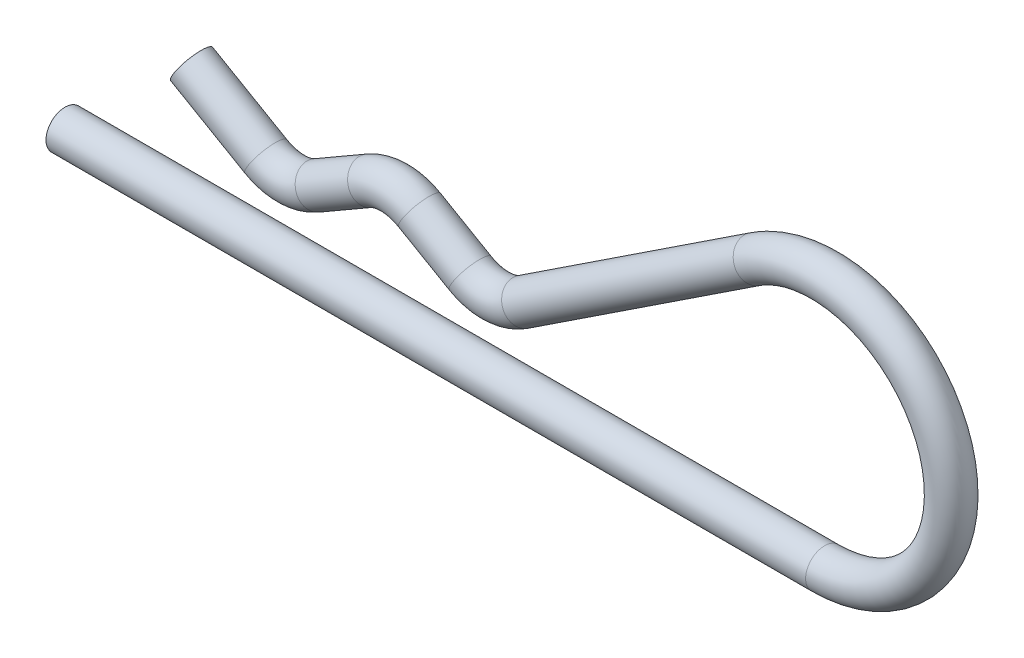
ISO-10303-21;
HEADER;
FILE_DESCRIPTION(('STEP AP214'),'2;1');
FILE_NAME('part.step','',(''),(''),'','','');
FILE_SCHEMA(('AUTOMOTIVE_DESIGN { 1 0 10303 214 1 1 1 1 }'));
ENDSEC;
DATA;
#1=APPLICATION_CONTEXT('core data for automotive mechanical design processes');
#2=APPLICATION_PROTOCOL_DEFINITION('international standard','automotive_design',2000,#1);
#3=PRODUCT_CONTEXT('',#1,'mechanical');
#4=PRODUCT('Part','Part','',(#3));
#5=PRODUCT_RELATED_PRODUCT_CATEGORY('part','',(#4));
#6=PRODUCT_DEFINITION_FORMATION('','',#4);
#7=PRODUCT_DEFINITION_CONTEXT('part definition',#1,'design');
#8=PRODUCT_DEFINITION('design','',#6,#7);
#9=PRODUCT_DEFINITION_SHAPE('','',#8);
#10=(LENGTH_UNIT() NAMED_UNIT(*) SI_UNIT(.MILLI.,.METRE.));
#11=(NAMED_UNIT(*) PLANE_ANGLE_UNIT() SI_UNIT($,.RADIAN.));
#12=(NAMED_UNIT(*) SI_UNIT($,.STERADIAN.) SOLID_ANGLE_UNIT());
#13=UNCERTAINTY_MEASURE_WITH_UNIT(LENGTH_MEASURE(1.E-05),#10,'distance_accuracy_value','');
#14=(GEOMETRIC_REPRESENTATION_CONTEXT(3) GLOBAL_UNCERTAINTY_ASSIGNED_CONTEXT((#13)) GLOBAL_UNIT_ASSIGNED_CONTEXT((#10,
#11,#12)) REPRESENTATION_CONTEXT('',''));
#15=CARTESIAN_POINT('',(0.,0.,0.));
#16=DIRECTION('',(0.,0.,1.));
#17=DIRECTION('',(1.,0.,0.));
#18=AXIS2_PLACEMENT_3D('',#15,#16,#17);
#19=CARTESIAN_POINT('',(9.9999999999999,9.45702875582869,0.));
#20=DIRECTION('',(-0.866025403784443,0.499999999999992,0.));
#21=DIRECTION('',(-0.499999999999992,-0.866025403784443,0.));
#22=AXIS2_PLACEMENT_3D('',#19,#20,#21);
#23=PLANE('',#22);
#24=CARTESIAN_POINT('',(9.99999999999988,9.4570287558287,0.));
#25=DIRECTION('',(-0.866025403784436,0.500000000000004,0.));
#26=DIRECTION('',(-0.500000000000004,-0.866025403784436,0.));
#27=AXIS2_PLACEMENT_3D('',#24,#25,#26);
#28=CIRCLE('',#27,1.5);
#29=CARTESIAN_POINT('',(9.24999999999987,8.15799065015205,0.));
#30=VERTEX_POINT('',#29);
#31=EDGE_CURVE('E17',#30,#30,#28,.F.);
#32=ORIENTED_EDGE('',*,*,#31,.F.);
#33=EDGE_LOOP('',(#32));
#34=FACE_BOUND('',#33,.T.);
#35=ADVANCED_FACE('F14',(#34),#23,.T.);
#36=CARTESIAN_POINT('',(15.8599001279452,6.0738138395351,0.));
#37=DIRECTION('',(-0.866025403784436,0.500000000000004,0.));
#38=DIRECTION('',(-0.500000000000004,-0.866025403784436,0.));
#39=AXIS2_PLACEMENT_3D('',#36,#37,#38);
#40=CYLINDRICAL_SURFACE('',#39,1.5);
#41=ORIENTED_EDGE('',*,*,#31,.T.);
#42=EDGE_LOOP('',(#41));
#43=FACE_BOUND('',#42,.T.);
#44=CARTESIAN_POINT('',(15.8599001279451,6.07381383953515,0.));
#45=DIRECTION('',(-0.866025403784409,0.500000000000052,0.));
#46=DIRECTION('',(-0.500000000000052,-0.866025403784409,0.));
#47=AXIS2_PLACEMENT_3D('',#44,#45,#46);
#48=CIRCLE('',#47,1.5);
#49=CARTESIAN_POINT('',(15.109900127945,4.77477573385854,0.));
#50=VERTEX_POINT('',#49);
#51=EDGE_CURVE('E28',#50,#50,#48,.F.);
#52=ORIENTED_EDGE('',*,*,#51,.F.);
#53=EDGE_LOOP('',(#52));
#54=FACE_BOUND('',#53,.T.);
#55=ADVANCED_FACE('F40',(#43,#54),#40,.T.);
#56=CARTESIAN_POINT('',(17.8599001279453,9.53791545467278,0.));
#57=DIRECTION('',(0.,0.,-1.));
#58=DIRECTION('',(-1.,0.,0.));
#59=AXIS2_PLACEMENT_3D('',#56,#57,#58);
#60=TOROIDAL_SURFACE('',#59,3.99999999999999,1.5);
#61=CARTESIAN_POINT('',(19.8599001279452,6.07381383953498,0.));
#62=DIRECTION('',(-0.866025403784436,-0.500000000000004,0.));
#63=DIRECTION('',(0.500000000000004,-0.866025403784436,0.));
#64=AXIS2_PLACEMENT_3D('',#61,#62,#63);
#65=CIRCLE('',#64,1.5);
#66=CARTESIAN_POINT('',(20.6099001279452,4.77477573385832,0.));
#67=VERTEX_POINT('',#66);
#68=EDGE_CURVE('E31',#67,#67,#65,.F.);
#69=ORIENTED_EDGE('',*,*,#68,.F.);
#70=EDGE_LOOP('',(#69));
#71=FACE_BOUND('',#70,.T.);
#72=ORIENTED_EDGE('',*,*,#51,.T.);
#73=EDGE_LOOP('',(#72));
#74=FACE_BOUND('',#73,.T.);
#75=ADVANCED_FACE('F36',(#71,#74),#60,.T.);
#76=CARTESIAN_POINT('',(23.9999999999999,8.46410161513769,0.));
#77=DIRECTION('',(-0.866025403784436,-0.500000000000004,0.));
#78=DIRECTION('',(0.500000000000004,-0.866025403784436,0.));
#79=AXIS2_PLACEMENT_3D('',#76,#77,#78);
#80=CYLINDRICAL_SURFACE('',#79,1.5);
#81=ORIENTED_EDGE('',*,*,#68,.T.);
#82=EDGE_LOOP('',(#81));
#83=FACE_BOUND('',#82,.T.);
#84=CARTESIAN_POINT('',(23.9999999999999,8.4641016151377,0.));
#85=DIRECTION('',(-0.866025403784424,-0.500000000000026,0.));
#86=DIRECTION('',(-0.500000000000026,0.866025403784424,0.));
#87=AXIS2_PLACEMENT_3D('',#84,#85,#86);
#88=CIRCLE('',#87,1.5);
#89=CARTESIAN_POINT('',(23.2499999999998,9.76313972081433,0.));
#90=VERTEX_POINT('',#89);
#91=EDGE_CURVE('E93',#90,#90,#88,.F.);
#92=ORIENTED_EDGE('',*,*,#91,.F.);
#93=EDGE_LOOP('',(#92));
#94=FACE_BOUND('',#93,.T.);
#95=ADVANCED_FACE('F39',(#83,#94),#80,.T.);
#96=CARTESIAN_POINT('',(26.,5.,0.));
#97=DIRECTION('',(0.,0.,1.));
#98=DIRECTION('',(1.,0.,0.));
#99=AXIS2_PLACEMENT_3D('',#96,#97,#98);
#100=TOROIDAL_SURFACE('',#99,4.,1.5);
#101=ORIENTED_EDGE('',*,*,#91,.T.);
#102=EDGE_LOOP('',(#101));
#103=FACE_BOUND('',#102,.T.);
#104=CARTESIAN_POINT('',(27.9999999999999,8.46410161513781,0.));
#105=DIRECTION('',(-0.866025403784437,0.500000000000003,0.));
#106=DIRECTION('',(-0.500000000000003,-0.866025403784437,0.));
#107=AXIS2_PLACEMENT_3D('',#104,#105,#106);
#108=CIRCLE('',#107,1.5);
#109=CARTESIAN_POINT('',(27.2499999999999,7.16506350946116,0.));
#110=VERTEX_POINT('',#109);
#111=EDGE_CURVE('E92',#110,#110,#108,.F.);
#112=ORIENTED_EDGE('',*,*,#111,.F.);
#113=EDGE_LOOP('',(#112));
#114=FACE_BOUND('',#113,.T.);
#115=ADVANCED_FACE('F86',(#103,#114),#100,.T.);
#116=CARTESIAN_POINT('',(31.9999999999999,6.15470053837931,0.));
#117=DIRECTION('',(-0.866025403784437,0.500000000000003,0.));
#118=DIRECTION('',(-0.500000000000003,-0.866025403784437,0.));
#119=AXIS2_PLACEMENT_3D('',#116,#117,#118);
#120=CYLINDRICAL_SURFACE('',#119,1.5);
#121=ORIENTED_EDGE('',*,*,#111,.T.);
#122=EDGE_LOOP('',(#121));
#123=FACE_BOUND('',#122,.T.);
#124=CARTESIAN_POINT('',(31.9999999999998,6.15470053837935,0.));
#125=DIRECTION('',(-0.866025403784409,0.500000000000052,0.));
#126=DIRECTION('',(-0.500000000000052,-0.866025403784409,0.));
#127=AXIS2_PLACEMENT_3D('',#124,#125,#126);
#128=CIRCLE('',#127,1.5);
#129=CARTESIAN_POINT('',(31.2499999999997,4.85566243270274,0.));
#130=VERTEX_POINT('',#129);
#131=EDGE_CURVE('E74',#130,#130,#128,.F.);
#132=ORIENTED_EDGE('',*,*,#131,.F.);
#133=EDGE_LOOP('',(#132));
#134=FACE_BOUND('',#133,.T.);
#135=ADVANCED_FACE('F83',(#123,#134),#120,.T.);
#136=CARTESIAN_POINT('',(34.,9.61880215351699,0.));
#137=DIRECTION('',(0.,0.,-1.));
#138=DIRECTION('',(-1.,0.,0.));
#139=AXIS2_PLACEMENT_3D('',#136,#137,#138);
#140=TOROIDAL_SURFACE('',#139,4.,1.5);
#141=CARTESIAN_POINT('',(36.2027980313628,6.27998786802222,0.));
#142=DIRECTION('',(-0.834703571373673,-0.550699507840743,0.));
#143=DIRECTION('',(0.550699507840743,-0.834703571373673,0.));
#144=AXIS2_PLACEMENT_3D('',#141,#142,#143);
#145=CIRCLE('',#144,1.5);
#146=CARTESIAN_POINT('',(37.028847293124,5.02793251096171,0.));
#147=VERTEX_POINT('',#146);
#148=EDGE_CURVE('E71',#147,#147,#145,.F.);
#149=ORIENTED_EDGE('',*,*,#148,.F.);
#150=EDGE_LOOP('',(#149));
#151=FACE_BOUND('',#150,.T.);
#152=ORIENTED_EDGE('',*,*,#131,.T.);
#153=EDGE_LOOP('',(#152));
#154=FACE_BOUND('',#153,.T.);
#155=ADVANCED_FACE('F79',(#151,#154),#140,.T.);
#156=CARTESIAN_POINT('',(54.4930049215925,18.3470357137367,0.));
#157=DIRECTION('',(-0.834703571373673,-0.550699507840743,0.));
#158=DIRECTION('',(0.550699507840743,-0.834703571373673,0.));
#159=AXIS2_PLACEMENT_3D('',#156,#157,#158);
#160=CYLINDRICAL_SURFACE('',#159,1.5);
#161=ORIENTED_EDGE('',*,*,#148,.T.);
#162=EDGE_LOOP('',(#161));
#163=FACE_BOUND('',#162,.T.);
#164=CARTESIAN_POINT('',(54.4930049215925,18.3470357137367,0.));
#165=DIRECTION('',(-0.834703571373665,-0.550699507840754,0.));
#166=DIRECTION('',(-0.550699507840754,0.834703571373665,0.));
#167=AXIS2_PLACEMENT_3D('',#164,#165,#166);
#168=CIRCLE('',#167,1.5);
#169=CARTESIAN_POINT('',(53.6669556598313,19.5990910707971,0.));
#170=VERTEX_POINT('',#169);
#171=EDGE_CURVE('E25',#170,#170,#168,.F.);
#172=ORIENTED_EDGE('',*,*,#171,.F.);
#173=EDGE_LOOP('',(#172));
#174=FACE_BOUND('',#173,.T.);
#175=ADVANCED_FACE('F82',(#163,#174),#160,.T.);
#176=CARTESIAN_POINT('',(0.,0.,0.));
#177=DIRECTION('',(1.,0.,0.));
#178=DIRECTION('',(0.,0.,-1.));
#179=AXIS2_PLACEMENT_3D('',#176,#177,#178);
#180=PLANE('',#179);
#181=CARTESIAN_POINT('',(0.,0.,0.));
#182=DIRECTION('',(-1.,0.,0.));
#183=DIRECTION('',(0.,0.,1.));
#184=AXIS2_PLACEMENT_3D('',#181,#182,#183);
#185=CIRCLE('',#184,1.5);
#186=CARTESIAN_POINT('',(0.,0.,1.5));
#187=VERTEX_POINT('',#186);
#188=EDGE_CURVE('E10',#187,#187,#185,.F.);
#189=ORIENTED_EDGE('',*,*,#188,.F.);
#190=EDGE_LOOP('',(#189));
#191=FACE_BOUND('',#190,.T.);
#192=ADVANCED_FACE('F60',(#191),#180,.F.);
#193=CARTESIAN_POINT('',(60.,10.,0.));
#194=DIRECTION('',(0.,0.,1.));
#195=DIRECTION('',(1.,0.,0.));
#196=AXIS2_PLACEMENT_3D('',#193,#194,#195);
#197=TOROIDAL_SURFACE('',#196,9.99999999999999,1.5);
#198=ORIENTED_EDGE('',*,*,#171,.T.);
#199=EDGE_LOOP('',(#198));
#200=FACE_BOUND('',#199,.T.);
#201=CARTESIAN_POINT('',(60.,0.,0.));
#202=DIRECTION('',(-1.,0.,0.));
#203=DIRECTION('',(0.,0.,1.));
#204=AXIS2_PLACEMENT_3D('',#201,#202,#203);
#205=CIRCLE('',#204,1.5);
#206=CARTESIAN_POINT('',(60.,0.,1.5));
#207=VERTEX_POINT('',#206);
#208=EDGE_CURVE('E21',#207,#207,#205,.T.);
#209=ORIENTED_EDGE('',*,*,#208,.F.);
#210=EDGE_LOOP('',(#209));
#211=FACE_BOUND('',#210,.T.);
#212=ADVANCED_FACE('F55',(#200,#211),#197,.T.);
#213=CARTESIAN_POINT('',(60.,0.,0.));
#214=DIRECTION('',(-1.,0.,0.));
#215=DIRECTION('',(0.,0.,1.));
#216=AXIS2_PLACEMENT_3D('',#213,#214,#215);
#217=CYLINDRICAL_SURFACE('',#216,1.5);
#218=ORIENTED_EDGE('',*,*,#188,.T.);
#219=EDGE_LOOP('',(#218));
#220=FACE_BOUND('',#219,.T.);
#221=ORIENTED_EDGE('',*,*,#208,.T.);
#222=EDGE_LOOP('',(#221));
#223=FACE_BOUND('',#222,.T.);
#224=ADVANCED_FACE('F53',(#220,#223),#217,.T.);
#225=CLOSED_SHELL('',(#35,#55,#75,#95,#115,#135,#155,#175,#192,#212,#224));
#226=MANIFOLD_SOLID_BREP('B1',#225);
#227=ADVANCED_BREP_SHAPE_REPRESENTATION('',(#18,#226),#14);
#228=SHAPE_DEFINITION_REPRESENTATION(#9,#227);
ENDSEC;
END-ISO-10303-21;
